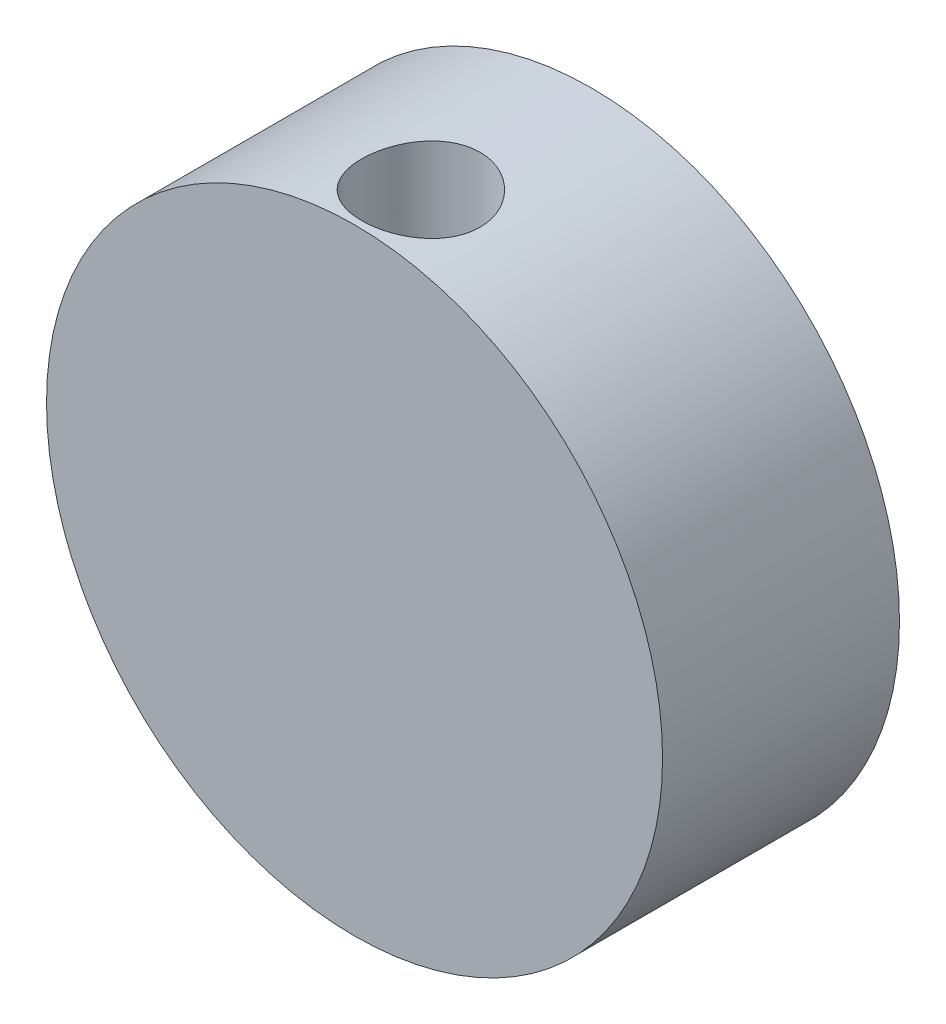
ISO-10303-21;
HEADER;
FILE_DESCRIPTION(('STEP AP214'),'2;1');
FILE_NAME('part.step','',(''),(''),'','','');
FILE_SCHEMA(('AUTOMOTIVE_DESIGN { 1 0 10303 214 1 1 1 1 }'));
ENDSEC;
DATA;
#1=APPLICATION_CONTEXT('core data for automotive mechanical design processes');
#2=APPLICATION_PROTOCOL_DEFINITION('international standard','automotive_design',2000,#1);
#3=PRODUCT_CONTEXT('',#1,'mechanical');
#4=PRODUCT('Part','Part','',(#3));
#5=PRODUCT_RELATED_PRODUCT_CATEGORY('part','',(#4));
#6=PRODUCT_DEFINITION_FORMATION('','',#4);
#7=PRODUCT_DEFINITION_CONTEXT('part definition',#1,'design');
#8=PRODUCT_DEFINITION('design','',#6,#7);
#9=PRODUCT_DEFINITION_SHAPE('','',#8);
#10=(LENGTH_UNIT() NAMED_UNIT(*) SI_UNIT(.MILLI.,.METRE.));
#11=(NAMED_UNIT(*) PLANE_ANGLE_UNIT() SI_UNIT($,.RADIAN.));
#12=(NAMED_UNIT(*) SI_UNIT($,.STERADIAN.) SOLID_ANGLE_UNIT());
#13=UNCERTAINTY_MEASURE_WITH_UNIT(LENGTH_MEASURE(1.E-05),#10,'distance_accuracy_value','');
#14=(GEOMETRIC_REPRESENTATION_CONTEXT(3) GLOBAL_UNCERTAINTY_ASSIGNED_CONTEXT((#13)) GLOBAL_UNIT_ASSIGNED_CONTEXT((#10,
#11,#12)) REPRESENTATION_CONTEXT('',''));
#15=CARTESIAN_POINT('',(0.,0.,0.));
#16=DIRECTION('',(0.,0.,1.));
#17=DIRECTION('',(1.,0.,0.));
#18=AXIS2_PLACEMENT_3D('',#15,#16,#17);
#19=CARTESIAN_POINT('',(0.,0.,50.));
#20=DIRECTION('',(0.,0.,-1.));
#21=DIRECTION('',(-1.,0.,0.));
#22=AXIS2_PLACEMENT_3D('',#19,#20,#21);
#23=CYLINDRICAL_SURFACE('',#22,65.);
#24=CARTESIAN_POINT('',(0.,-65.,48.5));
#25=CARTESIAN_POINT('',(0.347748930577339,-65.000003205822,48.500006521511));
#26=CARTESIAN_POINT('',(0.695414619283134,-64.9972044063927,48.4854845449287));
#27=CARTESIAN_POINT('',(1.38834324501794,-64.986094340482,48.4275231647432));
#28=CARTESIAN_POINT('',(1.73360574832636,-64.9777821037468,48.3840786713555));
#29=CARTESIAN_POINT('',(2.41937863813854,-64.9558652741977,48.2685625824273));
#30=CARTESIAN_POINT('',(2.75988543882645,-64.9422568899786,48.1964704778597));
#31=CARTESIAN_POINT('',(3.43349745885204,-64.910128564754,48.0242233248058));
#32=CARTESIAN_POINT('',(3.7666024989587,-64.8916085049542,47.9240675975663));
#33=CARTESIAN_POINT('',(4.42275210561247,-64.8501907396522,47.6965689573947));
#34=CARTESIAN_POINT('',(4.7458059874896,-64.8272972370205,47.5692521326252));
#35=CARTESIAN_POINT('',(5.37997032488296,-64.7777514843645,47.2883210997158));
#36=CARTESIAN_POINT('',(5.69108066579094,-64.751099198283,47.1347066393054));
#37=CARTESIAN_POINT('',(6.29922459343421,-64.6947681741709,46.8023072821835));
#38=CARTESIAN_POINT('',(6.5962594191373,-64.6650897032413,46.623524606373));
#39=CARTESIAN_POINT('',(7.1742983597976,-64.6035133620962,46.2420388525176));
#40=CARTESIAN_POINT('',(7.45530259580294,-64.5716155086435,46.0393359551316));
#41=CARTESIAN_POINT('',(8.00249541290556,-64.5060994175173,45.6089844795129));
#42=CARTESIAN_POINT('',(8.26848132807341,-64.472465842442,45.3810805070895));
#43=CARTESIAN_POINT('',(8.7803696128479,-64.4047496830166,44.9037952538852));
#44=CARTESIAN_POINT('',(9.02627182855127,-64.370667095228,44.6544138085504));
#45=CARTESIAN_POINT('',(9.49634014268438,-64.3030009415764,44.1358466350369));
#46=CARTESIAN_POINT('',(9.72050467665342,-64.2694174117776,43.8666594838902));
#47=CARTESIAN_POINT('',(10.145534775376,-64.2036944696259,43.3103124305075));
#48=CARTESIAN_POINT('',(10.3464002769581,-64.1715550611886,43.0231524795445));
#49=CARTESIAN_POINT('',(10.7250014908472,-64.1093711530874,42.4303242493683));
#50=CARTESIAN_POINT('',(10.9025292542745,-64.079346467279,42.1245210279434));
#51=CARTESIAN_POINT('',(11.231155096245,-64.0225661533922,41.498732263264));
#52=CARTESIAN_POINT('',(11.3822529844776,-63.9958105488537,41.1787466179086));
#53=CARTESIAN_POINT('',(11.6568658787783,-63.9463599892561,40.526870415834));
#54=CARTESIAN_POINT('',(11.7803828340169,-63.9236647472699,40.1949807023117));
#55=CARTESIAN_POINT('',(11.9988838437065,-63.883011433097,39.5216556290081));
#56=CARTESIAN_POINT('',(12.0938682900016,-63.8650532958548,39.1802204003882));
#57=CARTESIAN_POINT('',(12.2535694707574,-63.8346032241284,38.4944860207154));
#58=CARTESIAN_POINT('',(12.3186399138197,-63.8220475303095,38.1502720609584));
#59=CARTESIAN_POINT('',(12.4196784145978,-63.8024626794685,37.457442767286));
#60=CARTESIAN_POINT('',(12.4556466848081,-63.7954334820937,37.1088274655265));
#61=CARTESIAN_POINT('',(12.4981880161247,-63.7871128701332,36.4097685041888));
#62=CARTESIAN_POINT('',(12.5047635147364,-63.7858209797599,36.0593249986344));
#63=CARTESIAN_POINT('',(12.4884721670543,-63.7890126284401,35.3591510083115));
#64=CARTESIAN_POINT('',(12.4656055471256,-63.7934961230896,35.0094205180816));
#65=CARTESIAN_POINT('',(12.3911392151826,-63.8080016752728,34.3180781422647));
#66=CARTESIAN_POINT('',(12.3399436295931,-63.817945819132,33.9764209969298));
#67=CARTESIAN_POINT('',(12.2095072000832,-63.8430288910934,33.2987018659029));
#68=CARTESIAN_POINT('',(12.1302666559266,-63.8581677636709,32.9626398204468));
#69=CARTESIAN_POINT('',(11.9443457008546,-63.89320420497,32.2984403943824));
#70=CARTESIAN_POINT('',(11.8376644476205,-63.9131019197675,31.9703032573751));
#71=CARTESIAN_POINT('',(11.597661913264,-63.9570880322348,31.3242112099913));
#72=CARTESIAN_POINT('',(11.4643403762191,-63.9811764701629,31.0062563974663));
#73=CARTESIAN_POINT('',(11.1711107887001,-64.0330272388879,30.3807159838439));
#74=CARTESIAN_POINT('',(11.0110411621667,-64.06081167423,30.0732079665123));
#75=CARTESIAN_POINT('',(10.666056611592,-64.1191533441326,29.4727391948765));
#76=CARTESIAN_POINT('',(10.4811416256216,-64.1497105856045,29.1797784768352));
#77=CARTESIAN_POINT('',(10.0877362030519,-64.2127499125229,28.6103212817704));
#78=CARTESIAN_POINT('',(9.87924365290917,-64.2452321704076,28.3338262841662));
#79=CARTESIAN_POINT('',(9.44011326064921,-64.3112240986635,27.7991497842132));
#80=CARTESIAN_POINT('',(9.20947517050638,-64.3447337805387,27.5409684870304));
#81=CARTESIAN_POINT('',(8.72358689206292,-64.4124225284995,27.0404977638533));
#82=CARTESIAN_POINT('',(8.46799142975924,-64.4466034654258,26.7985436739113));
#83=CARTESIAN_POINT('',(7.93724822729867,-64.51411967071,26.3369894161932));
#84=CARTESIAN_POINT('',(7.66210026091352,-64.5474549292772,26.117389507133));
#85=CARTESIAN_POINT('',(7.09412252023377,-64.6123448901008,25.7020780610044));
#86=CARTESIAN_POINT('',(6.80129244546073,-64.6438995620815,25.5063669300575));
#87=CARTESIAN_POINT('',(6.19996114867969,-64.7043412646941,25.14023978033));
#88=CARTESIAN_POINT('',(5.89145999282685,-64.7332283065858,24.9698236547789));
#89=CARTESIAN_POINT('',(5.26048591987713,-64.7875580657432,24.6553220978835));
#90=CARTESIAN_POINT('',(4.93799431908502,-64.8129959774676,24.511273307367));
#91=CARTESIAN_POINT('',(4.28171029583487,-64.8596574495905,24.2508901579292));
#92=CARTESIAN_POINT('',(3.94791784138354,-64.8808809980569,24.1345558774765));
#93=CARTESIAN_POINT('',(3.27145874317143,-64.9185049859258,23.9305198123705));
#94=CARTESIAN_POINT('',(2.92879291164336,-64.9349058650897,23.8428154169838));
#95=CARTESIAN_POINT('',(2.23705899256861,-64.9624150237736,23.6967272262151));
#96=CARTESIAN_POINT('',(1.88799099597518,-64.9735233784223,23.6383430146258));
#97=CARTESIAN_POINT('',(1.19148039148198,-64.9899979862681,23.5520442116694));
#98=CARTESIAN_POINT('',(0.844096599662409,-64.9954506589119,23.523670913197));
#99=CARTESIAN_POINT('',(0.14813178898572,-65.0007626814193,23.4960271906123));
#100=CARTESIAN_POINT('',(-0.200449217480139,-65.0006220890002,23.4967564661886));
#101=CARTESIAN_POINT('',(-0.896268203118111,-64.9947517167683,23.5273109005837));
#102=CARTESIAN_POINT('',(-1.24350624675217,-64.9890222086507,23.5571346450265));
#103=CARTESIAN_POINT('',(-1.93415031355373,-64.9721354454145,23.6456377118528));
#104=CARTESIAN_POINT('',(-2.27755634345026,-64.9609781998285,23.7043169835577));
#105=CARTESIAN_POINT('',(-2.95526126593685,-64.933662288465,23.8494639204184));
#106=CARTESIAN_POINT('',(-3.28961199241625,-64.9175457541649,23.935697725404));
#107=CARTESIAN_POINT('',(-3.94980310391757,-64.88072414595,24.1354312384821));
#108=CARTESIAN_POINT('',(-4.27564355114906,-64.8600191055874,24.2489307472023));
#109=CARTESIAN_POINT('',(-4.91660553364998,-64.8145834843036,24.5023583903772));
#110=CARTESIAN_POINT('',(-5.2317264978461,-64.7898526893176,24.6422879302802));
#111=CARTESIAN_POINT('',(-5.84911560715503,-64.7370361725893,24.9475594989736));
#112=CARTESIAN_POINT('',(-6.15138360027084,-64.7089504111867,25.1129018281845));
#113=CARTESIAN_POINT('',(-6.74443415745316,-64.6498447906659,25.4698644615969));
#114=CARTESIAN_POINT('',(-7.03504602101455,-64.6187950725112,25.6617634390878));
#115=CARTESIAN_POINT('',(-7.5991250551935,-64.5548904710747,26.069022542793));
#116=CARTESIAN_POINT('',(-7.8725921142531,-64.5220355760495,26.2843828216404));
#117=CARTESIAN_POINT('',(-8.40058295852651,-64.4554189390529,26.7371089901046));
#118=CARTESIAN_POINT('',(-8.65510507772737,-64.421657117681,26.9744768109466));
#119=CARTESIAN_POINT('',(-9.14348097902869,-64.3541571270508,27.4696029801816));
#120=CARTESIAN_POINT('',(-9.37733464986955,-64.3204189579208,27.7273614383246));
#121=CARTESIAN_POINT('',(-9.82592521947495,-64.2534307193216,28.2653016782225));
#122=CARTESIAN_POINT('',(-10.0403477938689,-64.2201941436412,28.545747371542));
#123=CARTESIAN_POINT('',(-10.444806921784,-64.1556541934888,29.1239198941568));
#124=CARTESIAN_POINT('',(-10.6348432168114,-64.1243508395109,29.4216469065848));
#125=CARTESIAN_POINT('',(-10.9891503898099,-64.0645835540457,30.0323218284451));
#126=CARTESIAN_POINT('',(-11.1534219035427,-64.036119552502,30.345269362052));
#127=CARTESIAN_POINT('',(-11.4549819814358,-63.9828637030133,30.9842070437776));
#128=CARTESIAN_POINT('',(-11.5922707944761,-63.9580718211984,31.310197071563));
#129=CARTESIAN_POINT('',(-11.8381958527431,-63.9130086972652,31.9712459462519));
#130=CARTESIAN_POINT('',(-11.9469724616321,-63.892715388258,32.3062510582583));
#131=CARTESIAN_POINT('',(-12.1359239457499,-63.8570951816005,32.984494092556));
#132=CARTESIAN_POINT('',(-12.216098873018,-63.8417682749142,33.3277319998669));
#133=CARTESIAN_POINT('',(-12.3471986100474,-63.8165429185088,34.0199119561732));
#134=CARTESIAN_POINT('',(-12.3981263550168,-63.8066439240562,34.3688534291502));
#135=CARTESIAN_POINT('',(-12.4703283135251,-63.7925722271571,35.0699042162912));
#136=CARTESIAN_POINT('',(-12.491602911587,-63.7883994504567,35.4220134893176));
#137=CARTESIAN_POINT('',(-12.5042185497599,-63.7859275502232,36.1208823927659));
#138=CARTESIAN_POINT('',(-12.49605503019,-63.787531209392,36.4676328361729));
#139=CARTESIAN_POINT('',(-12.4509582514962,-63.7963491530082,37.1591825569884));
#140=CARTESIAN_POINT('',(-12.4140253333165,-63.8035633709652,37.503981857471));
#141=CARTESIAN_POINT('',(-12.3116834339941,-63.8233903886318,38.1891639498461));
#142=CARTESIAN_POINT('',(-12.2462747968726,-63.8360031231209,38.5295467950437));
#143=CARTESIAN_POINT('',(-12.0874921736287,-63.8662591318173,39.2034964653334));
#144=CARTESIAN_POINT('',(-11.9941180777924,-63.8839024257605,39.5370632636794));
#145=CARTESIAN_POINT('',(-11.7803420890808,-63.9236679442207,40.1943689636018));
#146=CARTESIAN_POINT('',(-11.6599970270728,-63.9457807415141,40.5181269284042));
#147=CARTESIAN_POINT('',(-11.3930617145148,-63.9938787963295,41.1543330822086));
#148=CARTESIAN_POINT('',(-11.2464715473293,-64.0198640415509,41.4667813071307));
#149=CARTESIAN_POINT('',(-10.9280918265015,-64.0749787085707,42.0782929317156));
#150=CARTESIAN_POINT('',(-10.7563008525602,-64.104108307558,42.3773555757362));
#151=CARTESIAN_POINT('',(-10.3887260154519,-64.1647025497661,42.9601044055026));
#152=CARTESIAN_POINT('',(-10.1929418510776,-64.1961672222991,43.2437903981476));
#153=CARTESIAN_POINT('',(-9.77545131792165,-64.2610757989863,43.7982607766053));
#154=CARTESIAN_POINT('',(-9.55338541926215,-64.2945430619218,44.0687717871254));
#155=CARTESIAN_POINT('',(-9.08740103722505,-64.362058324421,44.5901921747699));
#156=CARTESIAN_POINT('',(-8.84348227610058,-64.3961063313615,44.8411013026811));
#157=CARTESIAN_POINT('',(-8.33538842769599,-64.4638424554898,45.3216738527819));
#158=CARTESIAN_POINT('',(-8.07120869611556,-64.4975304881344,45.5513323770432));
#159=CARTESIAN_POINT('',(-7.52442597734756,-64.5636030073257,45.9877612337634));
#160=CARTESIAN_POINT('',(-7.24182314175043,-64.5959875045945,46.1945317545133));
#161=CARTESIAN_POINT('',(-6.65730741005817,-64.6588544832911,46.5856073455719));
#162=CARTESIAN_POINT('',(-6.35523545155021,-64.6893157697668,46.7696782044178));
#163=CARTESIAN_POINT('',(-5.73635293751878,-64.7471299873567,47.1116720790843));
#164=CARTESIAN_POINT('',(-5.41954241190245,-64.7744829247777,47.2695951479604));
#165=CARTESIAN_POINT('',(-4.77365668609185,-64.8252805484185,47.5579910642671));
#166=CARTESIAN_POINT('',(-4.44459166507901,-64.8487283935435,47.6884861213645));
#167=CARTESIAN_POINT('',(-3.77642605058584,-64.8910683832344,47.921148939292));
#168=CARTESIAN_POINT('',(-3.43732746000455,-64.9099614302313,48.0233223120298));
#169=CARTESIAN_POINT('',(-2.589848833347,-64.9503439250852,48.2398341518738));
#170=CARTESIAN_POINT('',(-2.07690701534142,-64.9688707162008,48.3372676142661));
#171=CARTESIAN_POINT('',(-1.04258097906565,-64.9936961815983,48.4673447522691));
#172=CARTESIAN_POINT('',(-0.521196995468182,-64.9999951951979,48.4999902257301));
#173=CARTESIAN_POINT('',(0.,-65.,48.5));
#174=B_SPLINE_CURVE_WITH_KNOTS('',3,(#24,#25,#26,#27,#28,#29,#30,#31,#32,#33,#34,#35,#36,#37,
#38,#39,#40,#41,#42,#43,#44,#45,#46,#47,#48,#49,#50,#51,#52,#53,#54,#55,#56,#57,#58,#59,#60,#61,
#62,#63,#64,#65,#66,#67,#68,#69,#70,#71,#72,#73,#74,#75,#76,#77,#78,#79,#80,#81,#82,#83,#84,#85,
#86,#87,#88,#89,#90,#91,#92,#93,#94,#95,#96,#97,#98,#99,#100,#101,#102,#103,#104,#105,#106,#107,
#108,#109,#110,#111,#112,#113,#114,#115,#116,#117,#118,#119,#120,#121,#122,#123,#124,#125,#126,
#127,#128,#129,#130,#131,#132,#133,#134,#135,#136,#137,#138,#139,#140,#141,#142,#143,#144,#145,
#146,#147,#148,#149,#150,#151,#152,#153,#154,#155,#156,#157,#158,#159,#160,#161,#162,#163,#164,
#165,#166,#167,#168,#169,#170,#171,#172,#173),.UNSPECIFIED.,.T.,.F.,(4,2,2,2,2,2,2,2,2,2,2,2,2,
2,2,2,2,2,2,2,2,2,2,2,2,2,2,2,2,2,2,2,2,2,2,2,2,2,2,2,2,2,2,2,2,2,2,2,2,2,2,2,2,2,2,2,2,2,2,2,2,
2,2,2,2,2,2,2,2,2,2,2,2,2,4),(0.,1.04278933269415,2.08576222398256,3.12948313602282,
4.17322929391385,5.21597741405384,6.25873553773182,7.30140170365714,8.34405999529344,
9.39846916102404,10.4528864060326,11.5073794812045,12.5618754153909,13.6252086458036,
14.6885495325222,15.7518152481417,16.8150663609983,17.8653998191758,18.915725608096,
19.9659642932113,21.0161949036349,22.0518159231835,23.0874258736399,24.1230676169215,
25.1587193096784,26.2008695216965,27.2430223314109,28.2852686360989,29.3275266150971,
30.3871025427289,31.4466907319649,32.5062969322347,33.5658986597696,34.6269618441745,
35.6880280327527,36.7489974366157,37.809951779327,38.8544444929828,39.8989264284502,
40.9433575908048,41.9877869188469,43.023577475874,44.0593604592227,45.0951985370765,
46.1310488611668,47.1787351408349,48.2264282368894,49.2742133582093,50.3220041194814,
51.3844988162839,52.447004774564,53.5094845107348,54.5719544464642,55.6290912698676,
56.6862261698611,57.7432549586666,58.8002700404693,59.8395793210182,60.8788762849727,
61.918160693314,62.9574491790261,63.994568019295,65.0316835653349,66.0688575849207,
67.1060446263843,68.1595580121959,69.2130847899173,70.2668537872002,71.3206141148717,
72.3844700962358,73.4483239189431,74.511312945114,75.5740911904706,77.1370399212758,
78.6999452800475),.UNSPECIFIED.);
#175=CARTESIAN_POINT('',(0.,-65.,48.5));
#176=VERTEX_POINT('',#175);
#177=EDGE_CURVE('E35',#176,#176,#174,.T.);
#178=ORIENTED_EDGE('',*,*,#177,.T.);
#179=EDGE_LOOP('',(#178));
#180=FACE_BOUND('',#179,.T.);
#181=CARTESIAN_POINT('',(0.,65.,48.5));
#182=CARTESIAN_POINT('',(-0.347748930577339,65.000003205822,48.500006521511));
#183=CARTESIAN_POINT('',(-0.695414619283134,64.9972044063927,48.4854845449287));
#184=CARTESIAN_POINT('',(-1.38834324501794,64.986094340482,48.4275231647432));
#185=CARTESIAN_POINT('',(-1.73360574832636,64.9777821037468,48.3840786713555));
#186=CARTESIAN_POINT('',(-2.41937863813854,64.9558652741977,48.2685625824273));
#187=CARTESIAN_POINT('',(-2.75988543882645,64.9422568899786,48.1964704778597));
#188=CARTESIAN_POINT('',(-3.43349745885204,64.910128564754,48.0242233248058));
#189=CARTESIAN_POINT('',(-3.7666024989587,64.8916085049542,47.9240675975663));
#190=CARTESIAN_POINT('',(-4.42275210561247,64.8501907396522,47.6965689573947));
#191=CARTESIAN_POINT('',(-4.7458059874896,64.8272972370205,47.5692521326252));
#192=CARTESIAN_POINT('',(-5.37997032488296,64.7777514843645,47.2883210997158));
#193=CARTESIAN_POINT('',(-5.69108066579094,64.751099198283,47.1347066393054));
#194=CARTESIAN_POINT('',(-6.29922459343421,64.6947681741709,46.8023072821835));
#195=CARTESIAN_POINT('',(-6.5962594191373,64.6650897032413,46.623524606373));
#196=CARTESIAN_POINT('',(-7.1742983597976,64.6035133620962,46.2420388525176));
#197=CARTESIAN_POINT('',(-7.45530259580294,64.5716155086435,46.0393359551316));
#198=CARTESIAN_POINT('',(-8.00249541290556,64.5060994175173,45.6089844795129));
#199=CARTESIAN_POINT('',(-8.26848132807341,64.472465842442,45.3810805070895));
#200=CARTESIAN_POINT('',(-8.7803696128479,64.4047496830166,44.9037952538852));
#201=CARTESIAN_POINT('',(-9.02627182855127,64.370667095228,44.6544138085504));
#202=CARTESIAN_POINT('',(-9.49634014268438,64.3030009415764,44.1358466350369));
#203=CARTESIAN_POINT('',(-9.72050467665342,64.2694174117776,43.8666594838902));
#204=CARTESIAN_POINT('',(-10.145534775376,64.2036944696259,43.3103124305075));
#205=CARTESIAN_POINT('',(-10.3464002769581,64.1715550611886,43.0231524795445));
#206=CARTESIAN_POINT('',(-10.7250014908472,64.1093711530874,42.4303242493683));
#207=CARTESIAN_POINT('',(-10.9025292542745,64.079346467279,42.1245210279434));
#208=CARTESIAN_POINT('',(-11.231155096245,64.0225661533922,41.498732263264));
#209=CARTESIAN_POINT('',(-11.3822529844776,63.9958105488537,41.1787466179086));
#210=CARTESIAN_POINT('',(-11.6568658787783,63.9463599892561,40.526870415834));
#211=CARTESIAN_POINT('',(-11.7803828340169,63.9236647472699,40.1949807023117));
#212=CARTESIAN_POINT('',(-11.9988838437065,63.883011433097,39.5216556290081));
#213=CARTESIAN_POINT('',(-12.0938682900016,63.8650532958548,39.1802204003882));
#214=CARTESIAN_POINT('',(-12.2535694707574,63.8346032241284,38.4944860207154));
#215=CARTESIAN_POINT('',(-12.3186399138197,63.8220475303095,38.1502720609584));
#216=CARTESIAN_POINT('',(-12.4196784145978,63.8024626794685,37.457442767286));
#217=CARTESIAN_POINT('',(-12.4556466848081,63.7954334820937,37.1088274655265));
#218=CARTESIAN_POINT('',(-12.4981880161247,63.7871128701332,36.4097685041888));
#219=CARTESIAN_POINT('',(-12.5047635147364,63.7858209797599,36.0593249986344));
#220=CARTESIAN_POINT('',(-12.4884721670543,63.7890126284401,35.3591510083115));
#221=CARTESIAN_POINT('',(-12.4656055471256,63.7934961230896,35.0094205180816));
#222=CARTESIAN_POINT('',(-12.3911392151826,63.8080016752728,34.3180781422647));
#223=CARTESIAN_POINT('',(-12.3399436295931,63.817945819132,33.9764209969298));
#224=CARTESIAN_POINT('',(-12.2095072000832,63.8430288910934,33.2987018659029));
#225=CARTESIAN_POINT('',(-12.1302666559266,63.8581677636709,32.9626398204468));
#226=CARTESIAN_POINT('',(-11.9443457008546,63.89320420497,32.2984403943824));
#227=CARTESIAN_POINT('',(-11.8376644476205,63.9131019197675,31.9703032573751));
#228=CARTESIAN_POINT('',(-11.597661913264,63.9570880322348,31.3242112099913));
#229=CARTESIAN_POINT('',(-11.4643403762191,63.9811764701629,31.0062563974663));
#230=CARTESIAN_POINT('',(-11.1711107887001,64.0330272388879,30.3807159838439));
#231=CARTESIAN_POINT('',(-11.0110411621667,64.06081167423,30.0732079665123));
#232=CARTESIAN_POINT('',(-10.666056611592,64.1191533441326,29.4727391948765));
#233=CARTESIAN_POINT('',(-10.4811416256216,64.1497105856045,29.1797784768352));
#234=CARTESIAN_POINT('',(-10.0877362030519,64.2127499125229,28.6103212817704));
#235=CARTESIAN_POINT('',(-9.87924365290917,64.2452321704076,28.3338262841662));
#236=CARTESIAN_POINT('',(-9.44011326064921,64.3112240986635,27.7991497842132));
#237=CARTESIAN_POINT('',(-9.20947517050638,64.3447337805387,27.5409684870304));
#238=CARTESIAN_POINT('',(-8.72358689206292,64.4124225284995,27.0404977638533));
#239=CARTESIAN_POINT('',(-8.46799142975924,64.4466034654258,26.7985436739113));
#240=CARTESIAN_POINT('',(-7.93724822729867,64.51411967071,26.3369894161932));
#241=CARTESIAN_POINT('',(-7.66210026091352,64.5474549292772,26.117389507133));
#242=CARTESIAN_POINT('',(-7.09412252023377,64.6123448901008,25.7020780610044));
#243=CARTESIAN_POINT('',(-6.80129244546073,64.6438995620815,25.5063669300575));
#244=CARTESIAN_POINT('',(-6.19996114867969,64.7043412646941,25.14023978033));
#245=CARTESIAN_POINT('',(-5.89145999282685,64.7332283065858,24.9698236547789));
#246=CARTESIAN_POINT('',(-5.26048591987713,64.7875580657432,24.6553220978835));
#247=CARTESIAN_POINT('',(-4.93799431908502,64.8129959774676,24.511273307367));
#248=CARTESIAN_POINT('',(-4.28171029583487,64.8596574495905,24.2508901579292));
#249=CARTESIAN_POINT('',(-3.94791784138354,64.8808809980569,24.1345558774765));
#250=CARTESIAN_POINT('',(-3.27145874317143,64.9185049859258,23.9305198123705));
#251=CARTESIAN_POINT('',(-2.92879291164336,64.9349058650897,23.8428154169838));
#252=CARTESIAN_POINT('',(-2.23705899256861,64.9624150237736,23.6967272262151));
#253=CARTESIAN_POINT('',(-1.88799099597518,64.9735233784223,23.6383430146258));
#254=CARTESIAN_POINT('',(-1.19148039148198,64.9899979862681,23.5520442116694));
#255=CARTESIAN_POINT('',(-0.844096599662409,64.9954506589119,23.523670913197));
#256=CARTESIAN_POINT('',(-0.14813178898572,65.0007626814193,23.4960271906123));
#257=CARTESIAN_POINT('',(0.200449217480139,65.0006220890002,23.4967564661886));
#258=CARTESIAN_POINT('',(0.896268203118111,64.9947517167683,23.5273109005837));
#259=CARTESIAN_POINT('',(1.24350624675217,64.9890222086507,23.5571346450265));
#260=CARTESIAN_POINT('',(1.93415031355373,64.9721354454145,23.6456377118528));
#261=CARTESIAN_POINT('',(2.27755634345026,64.9609781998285,23.7043169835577));
#262=CARTESIAN_POINT('',(2.95526126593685,64.933662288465,23.8494639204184));
#263=CARTESIAN_POINT('',(3.28961199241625,64.9175457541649,23.935697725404));
#264=CARTESIAN_POINT('',(3.94980310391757,64.88072414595,24.1354312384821));
#265=CARTESIAN_POINT('',(4.27564355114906,64.8600191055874,24.2489307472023));
#266=CARTESIAN_POINT('',(4.91660553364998,64.8145834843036,24.5023583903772));
#267=CARTESIAN_POINT('',(5.2317264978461,64.7898526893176,24.6422879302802));
#268=CARTESIAN_POINT('',(5.84911560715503,64.7370361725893,24.9475594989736));
#269=CARTESIAN_POINT('',(6.15138360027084,64.7089504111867,25.1129018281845));
#270=CARTESIAN_POINT('',(6.74443415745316,64.6498447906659,25.4698644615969));
#271=CARTESIAN_POINT('',(7.03504602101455,64.6187950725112,25.6617634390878));
#272=CARTESIAN_POINT('',(7.5991250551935,64.5548904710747,26.069022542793));
#273=CARTESIAN_POINT('',(7.8725921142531,64.5220355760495,26.2843828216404));
#274=CARTESIAN_POINT('',(8.40058295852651,64.4554189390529,26.7371089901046));
#275=CARTESIAN_POINT('',(8.65510507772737,64.421657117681,26.9744768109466));
#276=CARTESIAN_POINT('',(9.14348097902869,64.3541571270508,27.4696029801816));
#277=CARTESIAN_POINT('',(9.37733464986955,64.3204189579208,27.7273614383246));
#278=CARTESIAN_POINT('',(9.82592521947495,64.2534307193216,28.2653016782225));
#279=CARTESIAN_POINT('',(10.0403477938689,64.2201941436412,28.545747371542));
#280=CARTESIAN_POINT('',(10.444806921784,64.1556541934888,29.1239198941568));
#281=CARTESIAN_POINT('',(10.6348432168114,64.1243508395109,29.4216469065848));
#282=CARTESIAN_POINT('',(10.9891503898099,64.0645835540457,30.0323218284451));
#283=CARTESIAN_POINT('',(11.1534219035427,64.036119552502,30.345269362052));
#284=CARTESIAN_POINT('',(11.4549819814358,63.9828637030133,30.9842070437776));
#285=CARTESIAN_POINT('',(11.5922707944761,63.9580718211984,31.310197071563));
#286=CARTESIAN_POINT('',(11.8381958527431,63.9130086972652,31.9712459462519));
#287=CARTESIAN_POINT('',(11.9469724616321,63.892715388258,32.3062510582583));
#288=CARTESIAN_POINT('',(12.1359239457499,63.8570951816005,32.984494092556));
#289=CARTESIAN_POINT('',(12.216098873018,63.8417682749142,33.3277319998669));
#290=CARTESIAN_POINT('',(12.3471986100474,63.8165429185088,34.0199119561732));
#291=CARTESIAN_POINT('',(12.3981263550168,63.8066439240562,34.3688534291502));
#292=CARTESIAN_POINT('',(12.4703283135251,63.7925722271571,35.0699042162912));
#293=CARTESIAN_POINT('',(12.491602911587,63.7883994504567,35.4220134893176));
#294=CARTESIAN_POINT('',(12.5042185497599,63.7859275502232,36.1208823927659));
#295=CARTESIAN_POINT('',(12.49605503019,63.787531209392,36.4676328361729));
#296=CARTESIAN_POINT('',(12.4509582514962,63.7963491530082,37.1591825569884));
#297=CARTESIAN_POINT('',(12.4140253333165,63.8035633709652,37.503981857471));
#298=CARTESIAN_POINT('',(12.3116834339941,63.8233903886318,38.1891639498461));
#299=CARTESIAN_POINT('',(12.2462747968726,63.8360031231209,38.5295467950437));
#300=CARTESIAN_POINT('',(12.0874921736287,63.8662591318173,39.2034964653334));
#301=CARTESIAN_POINT('',(11.9941180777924,63.8839024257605,39.5370632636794));
#302=CARTESIAN_POINT('',(11.7803420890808,63.9236679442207,40.1943689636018));
#303=CARTESIAN_POINT('',(11.6599970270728,63.9457807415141,40.5181269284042));
#304=CARTESIAN_POINT('',(11.3930617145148,63.9938787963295,41.1543330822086));
#305=CARTESIAN_POINT('',(11.2464715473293,64.0198640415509,41.4667813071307));
#306=CARTESIAN_POINT('',(10.9280918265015,64.0749787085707,42.0782929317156));
#307=CARTESIAN_POINT('',(10.7563008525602,64.104108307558,42.3773555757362));
#308=CARTESIAN_POINT('',(10.3887260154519,64.1647025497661,42.9601044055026));
#309=CARTESIAN_POINT('',(10.1929418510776,64.1961672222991,43.2437903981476));
#310=CARTESIAN_POINT('',(9.77545131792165,64.2610757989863,43.7982607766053));
#311=CARTESIAN_POINT('',(9.55338541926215,64.2945430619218,44.0687717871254));
#312=CARTESIAN_POINT('',(9.08740103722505,64.362058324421,44.5901921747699));
#313=CARTESIAN_POINT('',(8.84348227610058,64.3961063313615,44.8411013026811));
#314=CARTESIAN_POINT('',(8.33538842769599,64.4638424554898,45.3216738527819));
#315=CARTESIAN_POINT('',(8.07120869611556,64.4975304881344,45.5513323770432));
#316=CARTESIAN_POINT('',(7.52442597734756,64.5636030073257,45.9877612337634));
#317=CARTESIAN_POINT('',(7.24182314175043,64.5959875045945,46.1945317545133));
#318=CARTESIAN_POINT('',(6.65730741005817,64.6588544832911,46.5856073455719));
#319=CARTESIAN_POINT('',(6.35523545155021,64.6893157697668,46.7696782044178));
#320=CARTESIAN_POINT('',(5.73635293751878,64.7471299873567,47.1116720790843));
#321=CARTESIAN_POINT('',(5.41954241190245,64.7744829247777,47.2695951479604));
#322=CARTESIAN_POINT('',(4.77365668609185,64.8252805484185,47.5579910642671));
#323=CARTESIAN_POINT('',(4.44459166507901,64.8487283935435,47.6884861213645));
#324=CARTESIAN_POINT('',(3.77642605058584,64.8910683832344,47.921148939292));
#325=CARTESIAN_POINT('',(3.43732746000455,64.9099614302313,48.0233223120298));
#326=CARTESIAN_POINT('',(2.589848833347,64.9503439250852,48.2398341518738));
#327=CARTESIAN_POINT('',(2.07690701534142,64.9688707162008,48.3372676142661));
#328=CARTESIAN_POINT('',(1.04258097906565,64.9936961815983,48.4673447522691));
#329=CARTESIAN_POINT('',(0.521196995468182,64.9999951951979,48.4999902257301));
#330=CARTESIAN_POINT('',(0.,65.,48.5));
#331=B_SPLINE_CURVE_WITH_KNOTS('',3,(#181,#182,#183,#184,#185,#186,#187,#188,#189,#190,#191,
#192,#193,#194,#195,#196,#197,#198,#199,#200,#201,#202,#203,#204,#205,#206,#207,#208,#209,#210,
#211,#212,#213,#214,#215,#216,#217,#218,#219,#220,#221,#222,#223,#224,#225,#226,#227,#228,#229,
#230,#231,#232,#233,#234,#235,#236,#237,#238,#239,#240,#241,#242,#243,#244,#245,#246,#247,#248,
#249,#250,#251,#252,#253,#254,#255,#256,#257,#258,#259,#260,#261,#262,#263,#264,#265,#266,#267,
#268,#269,#270,#271,#272,#273,#274,#275,#276,#277,#278,#279,#280,#281,#282,#283,#284,#285,#286,
#287,#288,#289,#290,#291,#292,#293,#294,#295,#296,#297,#298,#299,#300,#301,#302,#303,#304,#305,
#306,#307,#308,#309,#310,#311,#312,#313,#314,#315,#316,#317,#318,#319,#320,#321,#322,#323,#324,
#325,#326,#327,#328,#329,#330),.UNSPECIFIED.,.T.,.F.,(4,2,2,2,2,2,2,2,2,2,2,2,2,2,2,2,2,2,2,2,2,
2,2,2,2,2,2,2,2,2,2,2,2,2,2,2,2,2,2,2,2,2,2,2,2,2,2,2,2,2,2,2,2,2,2,2,2,2,2,2,2,2,2,2,2,2,2,2,2,
2,2,2,2,2,4),(0.,1.04278933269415,2.08576222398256,3.12948313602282,4.17322929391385,
5.21597741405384,6.25873553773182,7.30140170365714,8.34405999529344,9.39846916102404,
10.4528864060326,11.5073794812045,12.5618754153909,13.6252086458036,14.6885495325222,
15.7518152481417,16.8150663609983,17.8653998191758,18.915725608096,19.9659642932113,
21.0161949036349,22.0518159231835,23.0874258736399,24.1230676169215,25.1587193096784,
26.2008695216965,27.2430223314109,28.2852686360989,29.3275266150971,30.3871025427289,
31.4466907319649,32.5062969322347,33.5658986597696,34.6269618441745,35.6880280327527,
36.7489974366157,37.809951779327,38.8544444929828,39.8989264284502,40.9433575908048,
41.9877869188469,43.023577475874,44.0593604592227,45.0951985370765,46.1310488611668,
47.1787351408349,48.2264282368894,49.2742133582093,50.3220041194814,51.3844988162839,
52.447004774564,53.5094845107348,54.5719544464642,55.6290912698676,56.6862261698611,
57.7432549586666,58.8002700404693,59.8395793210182,60.8788762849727,61.918160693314,
62.9574491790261,63.994568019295,65.0316835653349,66.0688575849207,67.1060446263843,
68.1595580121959,69.2130847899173,70.2668537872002,71.3206141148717,72.3844700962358,
73.4483239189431,74.511312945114,75.5740911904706,77.1370399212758,78.6999452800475),.UNSPECIFIED.);
#332=CARTESIAN_POINT('',(0.,65.,48.5));
#333=VERTEX_POINT('',#332);
#334=EDGE_CURVE('E51',#333,#333,#331,.T.);
#335=ORIENTED_EDGE('',*,*,#334,.T.);
#336=EDGE_LOOP('',(#335));
#337=FACE_BOUND('',#336,.T.);
#338=CARTESIAN_POINT('',(0.,0.,50.));
#339=DIRECTION('',(0.,0.,1.));
#340=DIRECTION('',(1.,0.,0.));
#341=AXIS2_PLACEMENT_3D('',#338,#339,#340);
#342=CIRCLE('',#341,65.);
#343=CARTESIAN_POINT('',(65.,0.,50.));
#344=VERTEX_POINT('',#343);
#345=EDGE_CURVE('E10',#344,#344,#342,.T.);
#346=ORIENTED_EDGE('',*,*,#345,.F.);
#347=EDGE_LOOP('',(#346));
#348=FACE_BOUND('',#347,.T.);
#349=CARTESIAN_POINT('',(0.,0.,0.));
#350=DIRECTION('',(0.,0.,1.));
#351=DIRECTION('',(1.,0.,0.));
#352=AXIS2_PLACEMENT_3D('',#349,#350,#351);
#353=CIRCLE('',#352,65.);
#354=CARTESIAN_POINT('',(65.,0.,0.));
#355=VERTEX_POINT('',#354);
#356=EDGE_CURVE('E42',#355,#355,#353,.T.);
#357=ORIENTED_EDGE('',*,*,#356,.T.);
#358=EDGE_LOOP('',(#357));
#359=FACE_BOUND('',#358,.T.);
#360=ADVANCED_FACE('F31',(#180,#337,#348,#359),#23,.T.);
#361=CARTESIAN_POINT('',(0.,0.,50.));
#362=DIRECTION('',(0.,0.,1.));
#363=DIRECTION('',(1.,0.,0.));
#364=AXIS2_PLACEMENT_3D('',#361,#362,#363);
#365=PLANE('',#364);
#366=ORIENTED_EDGE('',*,*,#345,.T.);
#367=EDGE_LOOP('',(#366));
#368=FACE_BOUND('',#367,.T.);
#369=ADVANCED_FACE('F64',(#368),#365,.T.);
#370=CARTESIAN_POINT('',(0.,0.,0.));
#371=DIRECTION('',(0.,0.,1.));
#372=DIRECTION('',(1.,0.,0.));
#373=AXIS2_PLACEMENT_3D('',#370,#371,#372);
#374=PLANE('',#373);
#375=CARTESIAN_POINT('',(0.,0.,0.));
#376=DIRECTION('',(0.,0.,-1.));
#377=DIRECTION('',(-1.,0.,0.));
#378=AXIS2_PLACEMENT_3D('',#375,#376,#377);
#379=CIRCLE('',#378,50.);
#380=CARTESIAN_POINT('',(-50.,0.,0.));
#381=VERTEX_POINT('',#380);
#382=EDGE_CURVE('E49',#381,#381,#379,.T.);
#383=ORIENTED_EDGE('',*,*,#382,.F.);
#384=EDGE_LOOP('',(#383));
#385=FACE_BOUND('',#384,.T.);
#386=ORIENTED_EDGE('',*,*,#356,.F.);
#387=EDGE_LOOP('',(#386));
#388=FACE_BOUND('',#387,.T.);
#389=ADVANCED_FACE('F61',(#385,#388),#374,.F.);
#390=CARTESIAN_POINT('',(0.,-66.5,36.));
#391=DIRECTION('',(0.,1.,0.));
#392=DIRECTION('',(0.,0.,1.));
#393=AXIS2_PLACEMENT_3D('',#390,#391,#392);
#394=CYLINDRICAL_SURFACE('',#393,12.5);
#395=ORIENTED_EDGE('',*,*,#334,.F.);
#396=EDGE_LOOP('',(#395));
#397=FACE_BOUND('',#396,.T.);
#398=ORIENTED_EDGE('',*,*,#177,.F.);
#399=EDGE_LOOP('',(#398));
#400=FACE_BOUND('',#399,.T.);
#401=ADVANCED_FACE('F55',(#397,#400),#394,.F.);
#402=CARTESIAN_POINT('',(0.,0.,10.));
#403=DIRECTION('',(0.,0.,-1.));
#404=DIRECTION('',(-1.,0.,0.));
#405=AXIS2_PLACEMENT_3D('',#402,#403,#404);
#406=CYLINDRICAL_SURFACE('',#405,50.);
#407=CARTESIAN_POINT('',(0.,0.,10.));
#408=DIRECTION('',(0.,0.,-1.));
#409=DIRECTION('',(-1.,0.,0.));
#410=AXIS2_PLACEMENT_3D('',#407,#408,#409);
#411=CIRCLE('',#410,50.);
#412=CARTESIAN_POINT('',(-50.,0.,10.));
#413=VERTEX_POINT('',#412);
#414=EDGE_CURVE('E145',#413,#413,#411,.F.);
#415=ORIENTED_EDGE('',*,*,#414,.T.);
#416=EDGE_LOOP('',(#415));
#417=FACE_BOUND('',#416,.T.);
#418=ORIENTED_EDGE('',*,*,#382,.T.);
#419=EDGE_LOOP('',(#418));
#420=FACE_BOUND('',#419,.T.);
#421=ADVANCED_FACE('F60',(#417,#420),#406,.F.);
#422=CARTESIAN_POINT('',(0.,0.,10.));
#423=DIRECTION('',(0.,0.,-1.));
#424=DIRECTION('',(-1.,0.,0.));
#425=AXIS2_PLACEMENT_3D('',#422,#423,#424);
#426=PLANE('',#425);
#427=CARTESIAN_POINT('',(0.,0.,10.));
#428=DIRECTION('',(0.,0.,-1.));
#429=DIRECTION('',(-1.,0.,0.));
#430=AXIS2_PLACEMENT_3D('',#427,#428,#429);
#431=CIRCLE('',#430,60.);
#432=CARTESIAN_POINT('',(-60.,0.,10.));
#433=VERTEX_POINT('',#432);
#434=EDGE_CURVE('E146',#433,#433,#431,.T.);
#435=ORIENTED_EDGE('',*,*,#434,.F.);
#436=EDGE_LOOP('',(#435));
#437=FACE_BOUND('',#436,.T.);
#438=ORIENTED_EDGE('',*,*,#414,.F.);
#439=EDGE_LOOP('',(#438));
#440=FACE_BOUND('',#439,.T.);
#441=ADVANCED_FACE('F110',(#437,#440),#426,.F.);
#442=CARTESIAN_POINT('',(0.,0.,20.));
#443=DIRECTION('',(0.,0.,-1.));
#444=DIRECTION('',(-1.,0.,0.));
#445=AXIS2_PLACEMENT_3D('',#442,#443,#444);
#446=CYLINDRICAL_SURFACE('',#445,60.);
#447=CARTESIAN_POINT('',(0.,0.,20.));
#448=DIRECTION('',(0.,0.,-1.));
#449=DIRECTION('',(-1.,0.,0.));
#450=AXIS2_PLACEMENT_3D('',#447,#448,#449);
#451=CIRCLE('',#450,60.);
#452=CARTESIAN_POINT('',(-60.,0.,20.));
#453=VERTEX_POINT('',#452);
#454=EDGE_CURVE('E144',#453,#453,#451,.T.);
#455=ORIENTED_EDGE('',*,*,#454,.F.);
#456=EDGE_LOOP('',(#455));
#457=FACE_BOUND('',#456,.T.);
#458=ORIENTED_EDGE('',*,*,#434,.T.);
#459=EDGE_LOOP('',(#458));
#460=FACE_BOUND('',#459,.T.);
#461=ADVANCED_FACE('F118',(#457,#460),#446,.F.);
#462=CARTESIAN_POINT('',(0.,0.,20.));
#463=DIRECTION('',(0.,0.,-1.));
#464=DIRECTION('',(-1.,0.,0.));
#465=AXIS2_PLACEMENT_3D('',#462,#463,#464);
#466=PLANE('',#465);
#467=ORIENTED_EDGE('',*,*,#454,.T.);
#468=EDGE_LOOP('',(#467));
#469=FACE_BOUND('',#468,.T.);
#470=ADVANCED_FACE('F127',(#469),#466,.T.);
#471=CLOSED_SHELL('',(#360,#369,#389,#401,#421,#441,#461,#470));
#472=MANIFOLD_SOLID_BREP('B2',#471);
#473=ADVANCED_BREP_SHAPE_REPRESENTATION('',(#18,#472),#14);
#474=SHAPE_DEFINITION_REPRESENTATION(#9,#473);
ENDSEC;
END-ISO-10303-21;
